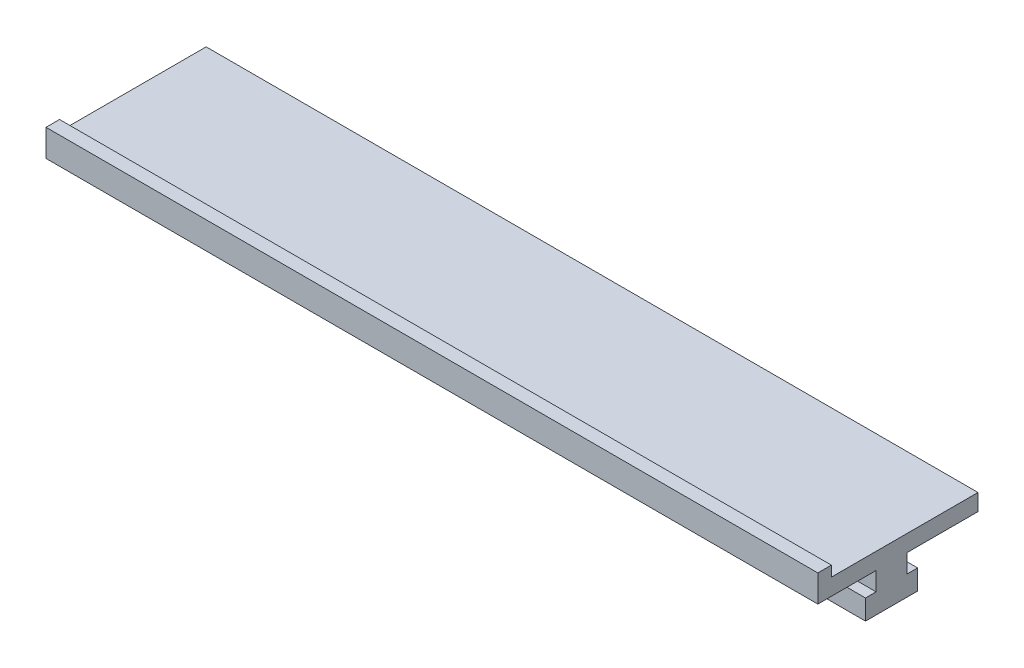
from build123d import *

# Parameters (mm, degrees)
LIUKUKISKOT_HIHNALLE_1_6050_LIUKUKISKO_7_DEPTH = 200


with BuildPart() as part:
    # Sketch1 → Liukukiskot hihnalle 1.6050 LIUKUKISKO 7 (new body)
    with BuildSketch(Plane(origin=(0, 0, 0), x_dir=(0, 0, -1), z_dir=(1, 0, 0))):
        Polygon((22.632843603, 4.632093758), (-15.367156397, 4.632093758), (-15.367156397, 7.332093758), (-18.867156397, 7.332093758), (-18.867156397, 0.332093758), (-3.767156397, 0.332093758), (-3.767156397, -4.467906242), (-6.517156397, -4.467906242), (-6.517156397, -9.667906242), (6.982843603, -9.667906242), (6.982843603, -4.467906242), (4.232843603, -4.467906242), (4.232843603, 0.332093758), (22.632843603, 0.332093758), align=None)
    extrude(amount=LIUKUKISKOT_HIHNALLE_1_6050_LIUKUKISKO_7_DEPTH)


solid = part.part
